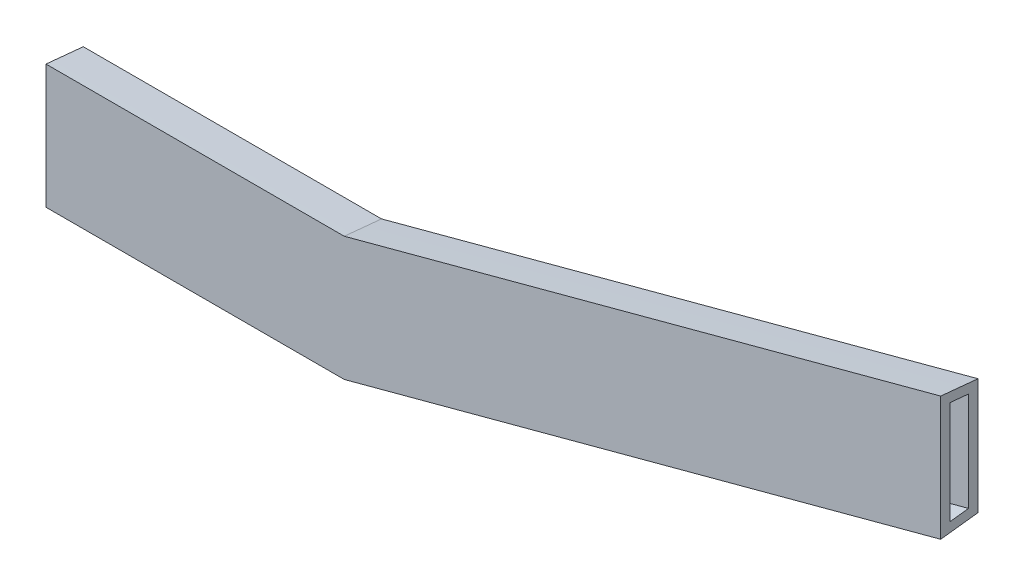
ISO-10303-21;
HEADER;
FILE_DESCRIPTION(('STEP AP214'),'2;1');
FILE_NAME('part.step','',(''),(''),'','','');
FILE_SCHEMA(('AUTOMOTIVE_DESIGN { 1 0 10303 214 1 1 1 1 }'));
ENDSEC;
DATA;
#1=APPLICATION_CONTEXT('core data for automotive mechanical design processes');
#2=APPLICATION_PROTOCOL_DEFINITION('international standard','automotive_design',2000,#1);
#3=PRODUCT_CONTEXT('',#1,'mechanical');
#4=PRODUCT('Part','Part','',(#3));
#5=PRODUCT_RELATED_PRODUCT_CATEGORY('part','',(#4));
#6=PRODUCT_DEFINITION_FORMATION('','',#4);
#7=PRODUCT_DEFINITION_CONTEXT('part definition',#1,'design');
#8=PRODUCT_DEFINITION('design','',#6,#7);
#9=PRODUCT_DEFINITION_SHAPE('','',#8);
#10=(LENGTH_UNIT() NAMED_UNIT(*) SI_UNIT(.MILLI.,.METRE.));
#11=(NAMED_UNIT(*) PLANE_ANGLE_UNIT() SI_UNIT($,.RADIAN.));
#12=(NAMED_UNIT(*) SI_UNIT($,.STERADIAN.) SOLID_ANGLE_UNIT());
#13=UNCERTAINTY_MEASURE_WITH_UNIT(LENGTH_MEASURE(1.E-05),#10,'distance_accuracy_value','');
#14=(GEOMETRIC_REPRESENTATION_CONTEXT(3) GLOBAL_UNCERTAINTY_ASSIGNED_CONTEXT((#13)) GLOBAL_UNIT_ASSIGNED_CONTEXT((#10,
#11,#12)) REPRESENTATION_CONTEXT('',''));
#15=CARTESIAN_POINT('',(0.,0.,0.));
#16=DIRECTION('',(0.,0.,1.));
#17=DIRECTION('',(1.,0.,0.));
#18=AXIS2_PLACEMENT_3D('',#15,#16,#17);
#19=CARTESIAN_POINT('',(0.,17.7868270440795,-65.881530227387));
#20=DIRECTION('',(-1.,0.,0.));
#21=DIRECTION('',(0.,0.,1.));
#22=AXIS2_PLACEMENT_3D('',#19,#20,#21);
#23=PLANE('',#22);
#24=CARTESIAN_POINT('',(0.,17.6298121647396,-67.46875));
#25=CARTESIAN_POINT('',(0.,17.7362869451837,-66.4107849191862));
#26=CARTESIAN_POINT('',(0.,17.839293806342,-65.3524623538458));
#27=CARTESIAN_POINT('',(0.,17.9380619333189,-64.29375));
#28=B_SPLINE_CURVE_WITH_KNOTS('',3,(#24,#25,#26,#27),.UNSPECIFIED.,.F.,.F.,(4,4),
(1.26620096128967,1.27664599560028),.UNSPECIFIED.);
#29=CARTESIAN_POINT('',(0.,17.6298121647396,-67.46875));
#30=VERTEX_POINT('',#29);
#31=CARTESIAN_POINT('',(0.,17.9380619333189,-64.29375));
#32=VERTEX_POINT('',#31);
#33=EDGE_CURVE('E166',#30,#32,#28,.T.);
#34=ORIENTED_EDGE('',*,*,#33,.F.);
#35=DIRECTION('',(0.,1.,0.));
#36=VECTOR('',#35,1.);
#37=CARTESIAN_POINT('',(0.,17.6298121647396,-67.46875));
#38=LINE('',#37,#36);
#39=CARTESIAN_POINT('',(0.,7.75018981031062,-67.46875));
#40=VERTEX_POINT('',#39);
#41=EDGE_CURVE('E77',#40,#30,#38,.T.);
#42=ORIENTED_EDGE('',*,*,#41,.F.);
#43=CARTESIAN_POINT('',(0.,7.37346725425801,-64.29375));
#44=CARTESIAN_POINT('',(0.,7.50404126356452,-65.3514781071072));
#45=CARTESIAN_POINT('',(0.,7.62969544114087,-66.4098262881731));
#46=CARTESIAN_POINT('',(0.,7.75018981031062,-67.46875));
#47=B_SPLINE_CURVE_WITH_KNOTS('',3,(#43,#44,#45,#46),.UNSPECIFIED.,.F.,.F.,(4,4),
(0.72836186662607,0.738787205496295),.UNSPECIFIED.);
#48=CARTESIAN_POINT('',(0.,7.37346725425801,-64.29375));
#49=VERTEX_POINT('',#48);
#50=EDGE_CURVE('E339',#49,#40,#47,.T.);
#51=ORIENTED_EDGE('',*,*,#50,.F.);
#52=DIRECTION('',(0.,-1.,0.));
#53=VECTOR('',#52,1.);
#54=CARTESIAN_POINT('',(0.,17.9380619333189,-64.29375));
#55=LINE('',#54,#53);
#56=EDGE_CURVE('E340',#32,#49,#55,.T.);
#57=ORIENTED_EDGE('',*,*,#56,.F.);
#58=EDGE_LOOP('',(#34,#42,#51,#57));
#59=FACE_BOUND('',#58,.T.);
#60=DIRECTION('',(0.,1.,0.));
#61=VECTOR('',#60,1.);
#62=CARTESIAN_POINT('',(0.,16.905642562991,-66.66865));
#63=LINE('',#62,#61);
#64=CARTESIAN_POINT('',(0.,8.46363213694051,-66.66865));
#65=VERTEX_POINT('',#64);
#66=CARTESIAN_POINT('',(0.,16.905642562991,-66.66865));
#67=VERTEX_POINT('',#66);
#68=EDGE_CURVE('E142',#65,#67,#63,.T.);
#69=ORIENTED_EDGE('',*,*,#68,.T.);
#70=CARTESIAN_POINT('',(0.,16.905642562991,-66.66865));
#71=CARTESIAN_POINT('',(0.,16.9576536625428,-66.1438079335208));
#72=CARTESIAN_POINT('',(0.,17.0087669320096,-65.6188759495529));
#73=CARTESIAN_POINT('',(0.,17.0588878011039,-65.09385));
#74=B_SPLINE_CURVE_WITH_KNOTS('',3,(#70,#71,#72,#73),.UNSPECIFIED.,.F.,.F.,(4,4),
(1.26857418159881,1.27376445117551),.UNSPECIFIED.);
#75=CARTESIAN_POINT('',(0.,17.0588878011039,-65.09385));
#76=VERTEX_POINT('',#75);
#77=EDGE_CURVE('E48',#67,#76,#74,.T.);
#78=ORIENTED_EDGE('',*,*,#77,.T.);
#79=DIRECTION('',(0.,-1.,0.));
#80=VECTOR('',#79,1.);
#81=CARTESIAN_POINT('',(0.,17.0588878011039,-65.09385));
#82=LINE('',#81,#80);
#83=CARTESIAN_POINT('',(0.,8.27720825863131,-65.09385));
#84=VERTEX_POINT('',#83);
#85=EDGE_CURVE('E439',#76,#84,#82,.T.);
#86=ORIENTED_EDGE('',*,*,#85,.T.);
#87=CARTESIAN_POINT('',(0.,8.27720825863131,-65.09385));
#88=CARTESIAN_POINT('',(0.,8.34058326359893,-65.6186358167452));
#89=CARTESIAN_POINT('',(0.,8.4027342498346,-66.1435709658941));
#90=CARTESIAN_POINT('',(0.,8.46363213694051,-66.66865));
#91=B_SPLINE_CURVE_WITH_KNOTS('',3,(#87,#88,#89,#90),.UNSPECIFIED.,.F.,.F.,(4,4),
(0.731305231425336,0.736463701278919),.UNSPECIFIED.);
#92=EDGE_CURVE('E442',#84,#65,#91,.T.);
#93=ORIENTED_EDGE('',*,*,#92,.T.);
#94=EDGE_LOOP('',(#69,#78,#86,#93));
#95=FACE_BOUND('',#94,.T.);
#96=ADVANCED_FACE('F32',(#59,#95),#23,.T.);
#97=CARTESIAN_POINT('',(25.4,17.6298121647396,-67.46875));
#98=CARTESIAN_POINT('',(25.4,17.7362869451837,-66.4107849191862));
#99=CARTESIAN_POINT('',(25.4,17.839293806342,-65.3524623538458));
#100=CARTESIAN_POINT('',(25.4,17.9380619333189,-64.29375));
#101=B_SPLINE_CURVE_WITH_KNOTS('',3,(#97,#98,#99,#100),.UNSPECIFIED.,.F.,.F.,(4,4),
(1.26620096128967,1.27664599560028),.UNSPECIFIED.);
#102=DIRECTION('',(-1.,0.,0.));
#103=VECTOR('',#102,1.);
#104=SURFACE_OF_LINEAR_EXTRUSION('',#101,#103);
#105=ORIENTED_EDGE('',*,*,#33,.T.);
#106=DIRECTION('',(-1.,0.,0.));
#107=VECTOR('',#106,1.);
#108=CARTESIAN_POINT('',(25.4,17.9380619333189,-64.29375));
#109=LINE('',#108,#107);
#110=CARTESIAN_POINT('',(25.4,17.9380619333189,-64.29375));
#111=VERTEX_POINT('',#110);
#112=EDGE_CURVE('E11',#111,#32,#109,.T.);
#113=ORIENTED_EDGE('',*,*,#112,.F.);
#114=CARTESIAN_POINT('',(25.4,17.6298121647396,-67.46875));
#115=VERTEX_POINT('',#114);
#116=EDGE_CURVE('E167',#115,#111,#101,.T.);
#117=ORIENTED_EDGE('',*,*,#116,.F.);
#118=DIRECTION('',(-1.,0.,0.));
#119=VECTOR('',#118,1.);
#120=CARTESIAN_POINT('',(25.4,17.6298121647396,-67.46875));
#121=LINE('',#120,#119);
#122=EDGE_CURVE('E180',#115,#30,#121,.T.);
#123=ORIENTED_EDGE('',*,*,#122,.T.);
#124=EDGE_LOOP('',(#105,#113,#117,#123));
#125=FACE_BOUND('',#124,.T.);
#126=ADVANCED_FACE('F34',(#125),#104,.F.);
#127=CARTESIAN_POINT('',(25.4,17.9380619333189,-64.29375));
#128=DIRECTION('',(0.,0.,-1.));
#129=DIRECTION('',(0.,1.,0.));
#130=AXIS2_PLACEMENT_3D('',#127,#128,#129);
#131=PLANE('',#130);
#132=ORIENTED_EDGE('',*,*,#56,.T.);
#133=DIRECTION('',(-1.,0.,0.));
#134=VECTOR('',#133,1.);
#135=CARTESIAN_POINT('',(25.4,7.37346725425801,-64.29375));
#136=LINE('',#135,#134);
#137=CARTESIAN_POINT('',(25.4,7.37346725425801,-64.29375));
#138=VERTEX_POINT('',#137);
#139=EDGE_CURVE('E41',#138,#49,#136,.T.);
#140=ORIENTED_EDGE('',*,*,#139,.F.);
#141=DIRECTION('',(0.965925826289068,0.258819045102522,0.));
#142=VECTOR('',#141,1.);
#143=CARTESIAN_POINT('',(25.4,7.37346725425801,-64.29375));
#144=LINE('',#143,#142);
#145=CARTESIAN_POINT('',(76.2,20.9852862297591,-64.29375));
#146=VERTEX_POINT('',#145);
#147=EDGE_CURVE('E323',#138,#146,#144,.T.);
#148=ORIENTED_EDGE('',*,*,#147,.T.);
#149=DIRECTION('',(0.,-1.,0.));
#150=VECTOR('',#149,1.);
#151=CARTESIAN_POINT('',(76.2,31.54988090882,-64.29375));
#152=LINE('',#151,#150);
#153=CARTESIAN_POINT('',(76.2,31.54988090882,-64.29375));
#154=VERTEX_POINT('',#153);
#155=EDGE_CURVE('E299',#154,#146,#152,.T.);
#156=ORIENTED_EDGE('',*,*,#155,.F.);
#157=DIRECTION('',(0.965925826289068,0.258819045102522,0.));
#158=VECTOR('',#157,1.);
#159=CARTESIAN_POINT('',(25.4,17.9380619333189,-64.29375));
#160=LINE('',#159,#158);
#161=EDGE_CURVE('E317',#111,#154,#160,.T.);
#162=ORIENTED_EDGE('',*,*,#161,.F.);
#163=ORIENTED_EDGE('',*,*,#112,.T.);
#164=EDGE_LOOP('',(#132,#140,#148,#156,#162,#163));
#165=FACE_BOUND('',#164,.T.);
#166=ADVANCED_FACE('F192',(#165),#131,.F.);
#167=CARTESIAN_POINT('',(25.4,7.37346725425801,-64.29375));
#168=CARTESIAN_POINT('',(25.4,7.50404126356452,-65.3514781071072));
#169=CARTESIAN_POINT('',(25.4,7.62969544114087,-66.4098262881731));
#170=CARTESIAN_POINT('',(25.4,7.75018981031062,-67.46875));
#171=B_SPLINE_CURVE_WITH_KNOTS('',3,(#167,#168,#169,#170),.UNSPECIFIED.,.F.,.F.,(4,4),
(0.72836186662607,0.738787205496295),.UNSPECIFIED.);
#172=DIRECTION('',(-1.,0.,0.));
#173=VECTOR('',#172,1.);
#174=SURFACE_OF_LINEAR_EXTRUSION('',#171,#173);
#175=ORIENTED_EDGE('',*,*,#50,.T.);
#176=DIRECTION('',(-1.,0.,0.));
#177=VECTOR('',#176,1.);
#178=CARTESIAN_POINT('',(25.4,7.75018981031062,-67.46875));
#179=LINE('',#178,#177);
#180=CARTESIAN_POINT('',(25.4,7.75018981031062,-67.46875));
#181=VERTEX_POINT('',#180);
#182=EDGE_CURVE('E57',#181,#40,#179,.T.);
#183=ORIENTED_EDGE('',*,*,#182,.F.);
#184=EDGE_CURVE('E172',#138,#181,#171,.T.);
#185=ORIENTED_EDGE('',*,*,#184,.F.);
#186=ORIENTED_EDGE('',*,*,#139,.T.);
#187=EDGE_LOOP('',(#175,#183,#185,#186));
#188=FACE_BOUND('',#187,.T.);
#189=ADVANCED_FACE('F188',(#188),#174,.F.);
#190=CARTESIAN_POINT('',(25.4,17.6298121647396,-67.46875));
#191=DIRECTION('',(0.,0.,1.));
#192=DIRECTION('',(0.,-1.,0.));
#193=AXIS2_PLACEMENT_3D('',#190,#191,#192);
#194=PLANE('',#193);
#195=ORIENTED_EDGE('',*,*,#41,.T.);
#196=ORIENTED_EDGE('',*,*,#122,.F.);
#197=DIRECTION('',(0.965925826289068,0.258819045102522,0.));
#198=VECTOR('',#197,1.);
#199=CARTESIAN_POINT('',(25.4,17.6298121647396,-67.46875));
#200=LINE('',#199,#198);
#201=CARTESIAN_POINT('',(76.2,31.2416311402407,-67.46875));
#202=VERTEX_POINT('',#201);
#203=EDGE_CURVE('E324',#115,#202,#200,.T.);
#204=ORIENTED_EDGE('',*,*,#203,.T.);
#205=DIRECTION('',(0.,1.,0.));
#206=VECTOR('',#205,1.);
#207=CARTESIAN_POINT('',(76.2,21.3620087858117,-67.46875));
#208=LINE('',#207,#206);
#209=CARTESIAN_POINT('',(76.2,21.3620087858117,-67.46875));
#210=VERTEX_POINT('',#209);
#211=EDGE_CURVE('E152',#210,#202,#208,.T.);
#212=ORIENTED_EDGE('',*,*,#211,.F.);
#213=DIRECTION('',(0.965925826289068,0.258819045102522,0.));
#214=VECTOR('',#213,1.);
#215=CARTESIAN_POINT('',(25.4,7.75018981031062,-67.46875));
#216=LINE('',#215,#214);
#217=EDGE_CURVE('E214',#181,#210,#216,.T.);
#218=ORIENTED_EDGE('',*,*,#217,.F.);
#219=ORIENTED_EDGE('',*,*,#182,.T.);
#220=EDGE_LOOP('',(#195,#196,#204,#212,#218,#219));
#221=FACE_BOUND('',#220,.T.);
#222=ADVANCED_FACE('F191',(#221),#194,.F.);
#223=CARTESIAN_POINT('',(25.4,16.905642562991,-66.66865));
#224=CARTESIAN_POINT('',(25.4,16.9576536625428,-66.1438079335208));
#225=CARTESIAN_POINT('',(25.4,17.0087669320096,-65.6188759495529));
#226=CARTESIAN_POINT('',(25.4,17.0588878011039,-65.09385));
#227=B_SPLINE_CURVE_WITH_KNOTS('',3,(#223,#224,#225,#226),.UNSPECIFIED.,.F.,.F.,(4,4),
(1.26857418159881,1.27376445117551),.UNSPECIFIED.);
#228=DIRECTION('',(-1.,0.,0.));
#229=VECTOR('',#228,1.);
#230=SURFACE_OF_LINEAR_EXTRUSION('',#227,#229);
#231=ORIENTED_EDGE('',*,*,#77,.F.);
#232=DIRECTION('',(-1.,0.,0.));
#233=VECTOR('',#232,1.);
#234=CARTESIAN_POINT('',(25.4,16.905642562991,-66.66865));
#235=LINE('',#234,#233);
#236=CARTESIAN_POINT('',(25.4,16.905642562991,-66.66865));
#237=VERTEX_POINT('',#236);
#238=EDGE_CURVE('E148',#237,#67,#235,.T.);
#239=ORIENTED_EDGE('',*,*,#238,.F.);
#240=CARTESIAN_POINT('',(25.4,17.0588878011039,-65.09385));
#241=VERTEX_POINT('',#240);
#242=EDGE_CURVE('E133',#237,#241,#227,.T.);
#243=ORIENTED_EDGE('',*,*,#242,.T.);
#244=DIRECTION('',(-1.,0.,0.));
#245=VECTOR('',#244,1.);
#246=CARTESIAN_POINT('',(25.4,17.0588878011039,-65.09385));
#247=LINE('',#246,#245);
#248=EDGE_CURVE('E165',#241,#76,#247,.T.);
#249=ORIENTED_EDGE('',*,*,#248,.T.);
#250=EDGE_LOOP('',(#231,#239,#243,#249));
#251=FACE_BOUND('',#250,.T.);
#252=ADVANCED_FACE('F154',(#251),#230,.T.);
#253=CARTESIAN_POINT('',(25.4,17.0588878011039,-65.09385));
#254=DIRECTION('',(0.,0.,-1.));
#255=DIRECTION('',(0.,1.,0.));
#256=AXIS2_PLACEMENT_3D('',#253,#254,#255);
#257=PLANE('',#256);
#258=ORIENTED_EDGE('',*,*,#85,.F.);
#259=ORIENTED_EDGE('',*,*,#248,.F.);
#260=DIRECTION('',(0.965925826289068,0.258819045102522,0.));
#261=VECTOR('',#260,1.);
#262=CARTESIAN_POINT('',(25.4,17.0588878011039,-65.09385));
#263=LINE('',#262,#261);
#264=CARTESIAN_POINT('',(76.2,30.6707067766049,-65.09385));
#265=VERTEX_POINT('',#264);
#266=EDGE_CURVE('E139',#241,#265,#263,.T.);
#267=ORIENTED_EDGE('',*,*,#266,.T.);
#268=DIRECTION('',(0.,-1.,0.));
#269=VECTOR('',#268,1.);
#270=CARTESIAN_POINT('',(76.2,30.6707067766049,-65.09385));
#271=LINE('',#270,#269);
#272=CARTESIAN_POINT('',(76.2,21.8890272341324,-65.09385));
#273=VERTEX_POINT('',#272);
#274=EDGE_CURVE('E290',#273,#265,#271,.F.);
#275=ORIENTED_EDGE('',*,*,#274,.F.);
#276=DIRECTION('',(0.965925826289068,0.258819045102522,0.));
#277=VECTOR('',#276,1.);
#278=CARTESIAN_POINT('',(25.4,8.27720825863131,-65.09385));
#279=LINE('',#278,#277);
#280=CARTESIAN_POINT('',(25.4,8.27720825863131,-65.09385));
#281=VERTEX_POINT('',#280);
#282=EDGE_CURVE('E285',#281,#273,#279,.T.);
#283=ORIENTED_EDGE('',*,*,#282,.F.);
#284=DIRECTION('',(-1.,0.,0.));
#285=VECTOR('',#284,1.);
#286=CARTESIAN_POINT('',(25.4,8.27720825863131,-65.09385));
#287=LINE('',#286,#285);
#288=EDGE_CURVE('E157',#281,#84,#287,.T.);
#289=ORIENTED_EDGE('',*,*,#288,.T.);
#290=EDGE_LOOP('',(#258,#259,#267,#275,#283,#289));
#291=FACE_BOUND('',#290,.T.);
#292=ADVANCED_FACE('F208',(#291),#257,.T.);
#293=CARTESIAN_POINT('',(25.4,8.27720825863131,-65.09385));
#294=CARTESIAN_POINT('',(25.4,8.34058326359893,-65.6186358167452));
#295=CARTESIAN_POINT('',(25.4,8.4027342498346,-66.1435709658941));
#296=CARTESIAN_POINT('',(25.4,8.46363213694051,-66.66865));
#297=B_SPLINE_CURVE_WITH_KNOTS('',3,(#293,#294,#295,#296),.UNSPECIFIED.,.F.,.F.,(4,4),
(0.731305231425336,0.736463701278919),.UNSPECIFIED.);
#298=DIRECTION('',(-1.,0.,0.));
#299=VECTOR('',#298,1.);
#300=SURFACE_OF_LINEAR_EXTRUSION('',#297,#299);
#301=ORIENTED_EDGE('',*,*,#92,.F.);
#302=ORIENTED_EDGE('',*,*,#288,.F.);
#303=CARTESIAN_POINT('',(25.4,8.46363213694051,-66.6686500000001));
#304=VERTEX_POINT('',#303);
#305=EDGE_CURVE('E141',#281,#304,#297,.T.);
#306=ORIENTED_EDGE('',*,*,#305,.T.);
#307=DIRECTION('',(-1.,0.,0.));
#308=VECTOR('',#307,1.);
#309=CARTESIAN_POINT('',(25.4,8.46363213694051,-66.66865));
#310=LINE('',#309,#308);
#311=EDGE_CURVE('E155',#304,#65,#310,.T.);
#312=ORIENTED_EDGE('',*,*,#311,.T.);
#313=EDGE_LOOP('',(#301,#302,#306,#312));
#314=FACE_BOUND('',#313,.T.);
#315=ADVANCED_FACE('F229',(#314),#300,.T.);
#316=CARTESIAN_POINT('',(25.4,16.905642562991,-66.66865));
#317=DIRECTION('',(0.,0.,1.));
#318=DIRECTION('',(0.,-1.,0.));
#319=AXIS2_PLACEMENT_3D('',#316,#317,#318);
#320=PLANE('',#319);
#321=ORIENTED_EDGE('',*,*,#68,.F.);
#322=ORIENTED_EDGE('',*,*,#311,.F.);
#323=DIRECTION('',(0.965925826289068,0.258819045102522,0.));
#324=VECTOR('',#323,1.);
#325=CARTESIAN_POINT('',(25.4,8.46363213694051,-66.6686500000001));
#326=LINE('',#325,#324);
#327=CARTESIAN_POINT('',(76.2,22.0754511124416,-66.6686500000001));
#328=VERTEX_POINT('',#327);
#329=EDGE_CURVE('E293',#304,#328,#326,.T.);
#330=ORIENTED_EDGE('',*,*,#329,.T.);
#331=DIRECTION('',(0.,1.,0.));
#332=VECTOR('',#331,1.);
#333=CARTESIAN_POINT('',(76.2,22.0754511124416,-66.6686500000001));
#334=LINE('',#333,#332);
#335=CARTESIAN_POINT('',(76.2,30.5174615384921,-66.66865));
#336=VERTEX_POINT('',#335);
#337=EDGE_CURVE('E151',#336,#328,#334,.F.);
#338=ORIENTED_EDGE('',*,*,#337,.F.);
#339=DIRECTION('',(0.965925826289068,0.258819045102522,0.));
#340=VECTOR('',#339,1.);
#341=CARTESIAN_POINT('',(25.4,16.905642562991,-66.66865));
#342=LINE('',#341,#340);
#343=EDGE_CURVE('E137',#237,#336,#342,.T.);
#344=ORIENTED_EDGE('',*,*,#343,.F.);
#345=ORIENTED_EDGE('',*,*,#238,.T.);
#346=EDGE_LOOP('',(#321,#322,#330,#338,#344,#345));
#347=FACE_BOUND('',#346,.T.);
#348=ADVANCED_FACE('F147',(#347),#320,.T.);
#349=CARTESIAN_POINT('',(25.4,17.6298121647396,-67.46875));
#350=CARTESIAN_POINT('',(76.2,31.2416311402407,-67.46875));
#351=CARTESIAN_POINT('',(25.4,17.7362869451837,-66.4107849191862));
#352=CARTESIAN_POINT('',(76.2,31.3481059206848,-66.4107849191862));
#353=CARTESIAN_POINT('',(25.4,17.839293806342,-65.3524623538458));
#354=CARTESIAN_POINT('',(76.2,31.4511127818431,-65.3524623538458));
#355=CARTESIAN_POINT('',(25.4,17.9380619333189,-64.29375));
#356=CARTESIAN_POINT('',(76.2,31.54988090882,-64.29375));
#357=B_SPLINE_SURFACE_WITH_KNOTS('',3,1,((#349,#350),(#351,#352),(#353,#354),(#355,#356)),
.UNSPECIFIED.,.F.,.F.,.F.,(4,4),(2,2),(0.,1.),(0.,1.),.UNSPECIFIED.);
#358=CARTESIAN_POINT('',(76.2,31.2416311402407,-67.46875));
#359=CARTESIAN_POINT('',(76.2,31.3481059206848,-66.4107849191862));
#360=CARTESIAN_POINT('',(76.2,31.4511127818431,-65.3524623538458));
#361=CARTESIAN_POINT('',(76.2,31.54988090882,-64.29375));
#362=B_SPLINE_CURVE_WITH_KNOTS('',3,(#358,#359,#360,#361),.UNSPECIFIED.,.F.,.F.,(4,4),
(1.26620096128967,1.27664599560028),.UNSPECIFIED.);
#363=EDGE_CURVE('E303',#202,#154,#362,.T.);
#364=ORIENTED_EDGE('',*,*,#161,.T.);
#365=ORIENTED_EDGE('',*,*,#363,.F.);
#366=ORIENTED_EDGE('',*,*,#203,.F.);
#367=ORIENTED_EDGE('',*,*,#116,.T.);
#368=EDGE_LOOP('',(#364,#365,#366,#367));
#369=FACE_BOUND('',#368,.T.);
#370=ADVANCED_FACE('F235',(#369),#357,.T.);
#371=CARTESIAN_POINT('',(25.4,7.37346725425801,-64.29375));
#372=CARTESIAN_POINT('',(76.2,20.9852862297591,-64.29375));
#373=CARTESIAN_POINT('',(25.4,7.50404126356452,-65.3514781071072));
#374=CARTESIAN_POINT('',(76.2,21.1158602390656,-65.3514781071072));
#375=CARTESIAN_POINT('',(25.4,7.62969544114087,-66.4098262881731));
#376=CARTESIAN_POINT('',(76.2,21.2415144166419,-66.4098262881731));
#377=CARTESIAN_POINT('',(25.4,7.75018981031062,-67.46875));
#378=CARTESIAN_POINT('',(76.2,21.3620087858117,-67.46875));
#379=B_SPLINE_SURFACE_WITH_KNOTS('',3,1,((#371,#372),(#373,#374),(#375,#376),(#377,#378)),
.UNSPECIFIED.,.F.,.F.,.F.,(4,4),(2,2),(0.,1.),(0.,1.),.UNSPECIFIED.);
#380=CARTESIAN_POINT('',(76.2,20.9852862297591,-64.29375));
#381=CARTESIAN_POINT('',(76.2,21.1158602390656,-65.3514781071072));
#382=CARTESIAN_POINT('',(76.2,21.2415144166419,-66.4098262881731));
#383=CARTESIAN_POINT('',(76.2,21.3620087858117,-67.46875));
#384=B_SPLINE_CURVE_WITH_KNOTS('',3,(#380,#381,#382,#383),.UNSPECIFIED.,.F.,.F.,(4,4),
(0.72836186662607,0.738787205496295),.UNSPECIFIED.);
#385=EDGE_CURVE('E302',#146,#210,#384,.T.);
#386=ORIENTED_EDGE('',*,*,#217,.T.);
#387=ORIENTED_EDGE('',*,*,#385,.F.);
#388=ORIENTED_EDGE('',*,*,#147,.F.);
#389=ORIENTED_EDGE('',*,*,#184,.T.);
#390=EDGE_LOOP('',(#386,#387,#388,#389));
#391=FACE_BOUND('',#390,.T.);
#392=ADVANCED_FACE('F236',(#391),#379,.T.);
#393=CARTESIAN_POINT('',(76.2,31.3986460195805,-65.881530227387));
#394=DIRECTION('',(-1.,0.,0.));
#395=DIRECTION('',(0.,0.,1.));
#396=AXIS2_PLACEMENT_3D('',#393,#394,#395);
#397=PLANE('',#396);
#398=ORIENTED_EDGE('',*,*,#363,.T.);
#399=ORIENTED_EDGE('',*,*,#155,.T.);
#400=ORIENTED_EDGE('',*,*,#385,.T.);
#401=ORIENTED_EDGE('',*,*,#211,.T.);
#402=EDGE_LOOP('',(#398,#399,#400,#401));
#403=FACE_BOUND('',#402,.T.);
#404=CARTESIAN_POINT('',(76.2,-406.74240198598,-23.3236338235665));
#405=DIRECTION('',(1.,0.,0.));
#406=DIRECTION('',(0.,0.,-1.));
#407=AXIS2_PLACEMENT_3D('',#404,#405,#406);
#408=CIRCLE('',#407,439.402979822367);
#409=EDGE_CURVE('E297',#265,#336,#408,.F.);
#410=ORIENTED_EDGE('',*,*,#409,.T.);
#411=ORIENTED_EDGE('',*,*,#337,.T.);
#412=CARTESIAN_POINT('',(76.2,-311.738148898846,-105.386869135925));
#413=DIRECTION('',(-1.,0.,0.));
#414=DIRECTION('',(0.,0.,-1.));
#415=AXIS2_PLACEMENT_3D('',#412,#413,#414);
#416=CIRCLE('',#415,336.051513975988);
#417=EDGE_CURVE('E286',#328,#273,#416,.F.);
#418=ORIENTED_EDGE('',*,*,#417,.T.);
#419=ORIENTED_EDGE('',*,*,#274,.T.);
#420=EDGE_LOOP('',(#410,#411,#418,#419));
#421=FACE_BOUND('',#420,.T.);
#422=ADVANCED_FACE('F241',(#403,#421),#397,.F.);
#423=CARTESIAN_POINT('',(25.4,8.46363213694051,-66.6686499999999));
#424=CARTESIAN_POINT('',(76.2,22.0754511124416,-66.6686499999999));
#425=CARTESIAN_POINT('',(25.4,8.40272946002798,-66.1435705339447));
#426=CARTESIAN_POINT('',(76.2,22.0145484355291,-66.1435705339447));
#427=CARTESIAN_POINT('',(25.4,8.34058805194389,-65.6186362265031));
#428=CARTESIAN_POINT('',(76.2,21.952407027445,-65.6186362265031));
#429=CARTESIAN_POINT('',(25.4,8.27720825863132,-65.0938499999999));
#430=CARTESIAN_POINT('',(76.2,21.8890272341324,-65.0938499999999));
#431=(BOUNDED_SURFACE() B_SPLINE_SURFACE(3,1,((#423,#424),(#425,#426),(#427,#428),(#429,#430)),
.UNSPECIFIED.,.F.,.F.,.F.) B_SPLINE_SURFACE_WITH_KNOTS((4,4),(2,2),(0.,1.),(0.,1.),
.UNSPECIFIED.) GEOMETRIC_REPRESENTATION_ITEM() RATIONAL_B_SPLINE_SURFACE(((1.,1.),
(0.999998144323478,0.999998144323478),(0.999998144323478,0.999998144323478),(1.,1.))) REPRESENTATION_ITEM('') SURFACE());
#432=ORIENTED_EDGE('',*,*,#282,.T.);
#433=ORIENTED_EDGE('',*,*,#417,.F.);
#434=ORIENTED_EDGE('',*,*,#329,.F.);
#435=ORIENTED_EDGE('',*,*,#305,.F.);
#436=EDGE_LOOP('',(#432,#433,#434,#435));
#437=FACE_BOUND('',#436,.T.);
#438=ADVANCED_FACE('F260',(#437),#431,.T.);
#439=CARTESIAN_POINT('',(25.4,17.058887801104,-65.09385));
#440=CARTESIAN_POINT('',(76.2,30.6707067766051,-65.09385));
#441=CARTESIAN_POINT('',(25.4,17.0087511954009,-65.6188750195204));
#442=CARTESIAN_POINT('',(76.2,30.6205701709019,-65.6188750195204));
#443=CARTESIAN_POINT('',(25.4,16.9576693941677,-66.143808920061));
#444=CARTESIAN_POINT('',(76.2,30.5694883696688,-66.143808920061));
#445=CARTESIAN_POINT('',(25.4,16.9056425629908,-66.66865));
#446=CARTESIAN_POINT('',(76.2,30.5174615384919,-66.66865));
#447=(BOUNDED_SURFACE() B_SPLINE_SURFACE(3,1,((#439,#440),(#441,#442),(#443,#444),(#445,#446)),
.UNSPECIFIED.,.F.,.F.,.F.) B_SPLINE_SURFACE_WITH_KNOTS((4,4),(2,2),(0.,1.),(0.,1.),
.UNSPECIFIED.) GEOMETRIC_REPRESENTATION_ITEM() RATIONAL_B_SPLINE_SURFACE(((1.,1.),
(0.999998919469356,0.999998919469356),(0.999998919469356,0.999998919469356),(1.,1.))) REPRESENTATION_ITEM('') SURFACE());
#448=ORIENTED_EDGE('',*,*,#409,.F.);
#449=ORIENTED_EDGE('',*,*,#266,.F.);
#450=ORIENTED_EDGE('',*,*,#242,.F.);
#451=ORIENTED_EDGE('',*,*,#343,.T.);
#452=EDGE_LOOP('',(#448,#449,#450,#451));
#453=FACE_BOUND('',#452,.T.);
#454=ADVANCED_FACE('F136',(#453),#447,.T.);
#455=CLOSED_SHELL('',(#96,#126,#166,#189,#222,#252,#292,#315,#348,#370,#392,#422,#438,#454));
#456=MANIFOLD_SOLID_BREP('B2',#455);
#457=ADVANCED_BREP_SHAPE_REPRESENTATION('',(#18,#456),#14);
#458=SHAPE_DEFINITION_REPRESENTATION(#9,#457);
ENDSEC;
END-ISO-10303-21;
